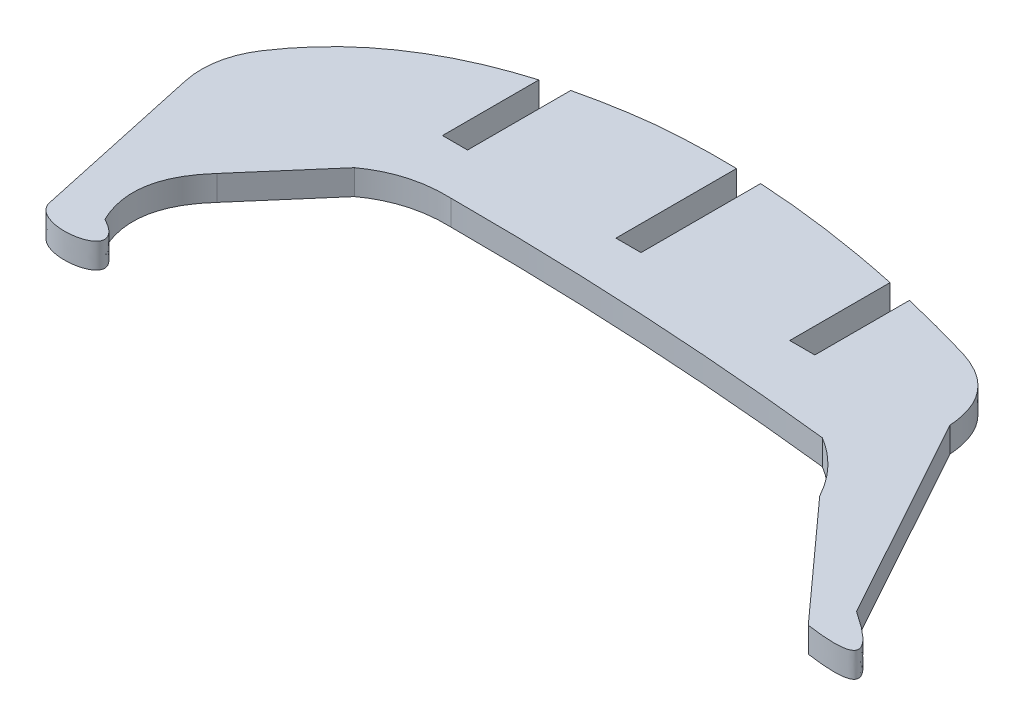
from build123d import *

# Parameters (mm, degrees)
SALIENTE_EXTRUIR1_DEPTH = 3


with BuildPart() as part:
    # Croquis2 → Saliente-Extruir1 (new body)
    with BuildSketch(Plane(origin=(0, 0, 0), x_dir=(1, 0, 0), z_dir=(0, 1, 0))):
        with BuildLine():
            Line((55.05664845, 13.565418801), (68.782529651, -11.313386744))
            add(Edge.make_bspline(
                [(68.782529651, -11.313386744), (77.521204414, -17.073437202), (67.312800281, -15.617594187)],
                knots=[0, 0, 0, 1, 1, 1], degree=2))
            Line((67.312800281, -15.617594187), (54.61013929, -1.550184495))
            add(Edge.make_bspline(
                [(54.61013929, -1.550184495), (52.48223182, 2.391634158), (48.731221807, 4.643674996)],
                knots=[0, 0, 0, 1, 1, 1], degree=2))
            add(Edge.make_bspline(
                [(48.731221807, 4.643674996), (25.250191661, 7.274969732), (1.694465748, 7.25441614)],
                knots=[0, 0, 0, 1, 1, 1], degree=2))
            add(Edge.make_bspline(
                [(1.694465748, 7.25441614), (-3.387128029, 7.431978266), (-7.233716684, 4.643674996)],
                knots=[0, 0, 0, 1, 1, 1], degree=2))
            Line((-7.233716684, 4.643674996), (-14.858812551, -4.18322766))
            add(Edge.make_bspline(
                [(-14.858812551, -4.18322766), (-19.741212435, -9.599255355), (-16.807448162, -15.617594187)],
                knots=[0, 0, 0, 1, 1, 1], degree=2))
            add(Edge.make_bspline(
                [(-16.807448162, -15.617594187), (-10.243726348, -19.164397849), (-21.362654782, -21.052449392), (-21.890845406, -16.976444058)],
                knots=[0, 0, 0, 0, 1, 1, 1, 1], degree=3))
            Line((-21.890845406, -16.976444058), (-26.340587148, 3.549783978))
            ThreePointArc((-26.340587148, 3.549783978), (-26.397737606, 7.503678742), (-24.917792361, 11.170600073))
            add(Edge.make_bspline(
                [(-24.917792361, 11.170600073), (-21.21604545, 16.788418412), (-14.62205488, 21.547295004), (-7.024278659, 24.247555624), (-5.293400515, 24.765059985)],
                knots=[0.102537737, 0.102537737, 0.102537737, 0.102537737, 0.571137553, 0.706215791, 0.706215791, 0.706215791, 0.706215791], degree=3))
            Line((-5.293400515, 24.765059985), (-5.293400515, 13.232020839))
            Line((-5.293400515, 13.232020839), (-2.293400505, 13.232020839))
            Line((-2.293400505, 13.232020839), (-2.293400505, 25.571830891))
            add(Edge.make_bspline(
                [(-2.293400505, 25.571830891), (1.936182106, 26.589886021), (6.237286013, 27.079665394)],
                knots=[0.783562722, 0.783562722, 0.783562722, 1, 1, 1], degree=2))
            add(Edge.make_bspline(
                [(6.237286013, 27.079665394), (9.270834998, 27.372599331), (12.427272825, 27.480949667), (15.706599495, 27.404716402)],
                knots=[0.396665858, 0.396665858, 0.396665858, 0.396665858, 0.54813025, 0.54813025, 0.54813025, 0.54813025], degree=3))
            Line((15.706599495, 27.404716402), (15.706599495, 12.978867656))
            Line((15.706599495, 12.978867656), (18.7065995, 12.978867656))
            Line((18.7065995, 12.978867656), (18.7065995, 27.285407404))
            add(Edge.make_bspline(
                [(18.7065995, 27.285407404), (24.357629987, 26.969359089), (30.357629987, 26.129145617), (36.7065995, 24.764766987)],
                knots=[0.59380183, 0.59380183, 0.59380183, 0.59380183, 0.849041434, 0.849041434, 0.849041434, 0.849041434], degree=3))
            Line((36.7065995, 24.764766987), (36.7065995, 12.76745739))
            Line((36.7065995, 12.76745739), (39.706599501, 12.76745739))
            Line((39.706599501, 12.76745739), (39.706599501, 24.087211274))
            add(Edge.make_bspline(
                [(39.706599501, 24.087211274), (43.923067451, 23.089505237), (48.337885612, 21.793869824)],
                knots=[0.888901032, 0.888901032, 0.888901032, 1, 1, 1], degree=2))
            add(Edge.make_bspline(
                [(48.337885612, 21.793869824), (54.650254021, 19.854880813), (55.05664845, 13.565418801)],
                knots=[0, 0, 0, 1, 1, 1], degree=2))
        make_face()
    extrude(amount=SALIENTE_EXTRUIR1_DEPTH)


solid = part.part
